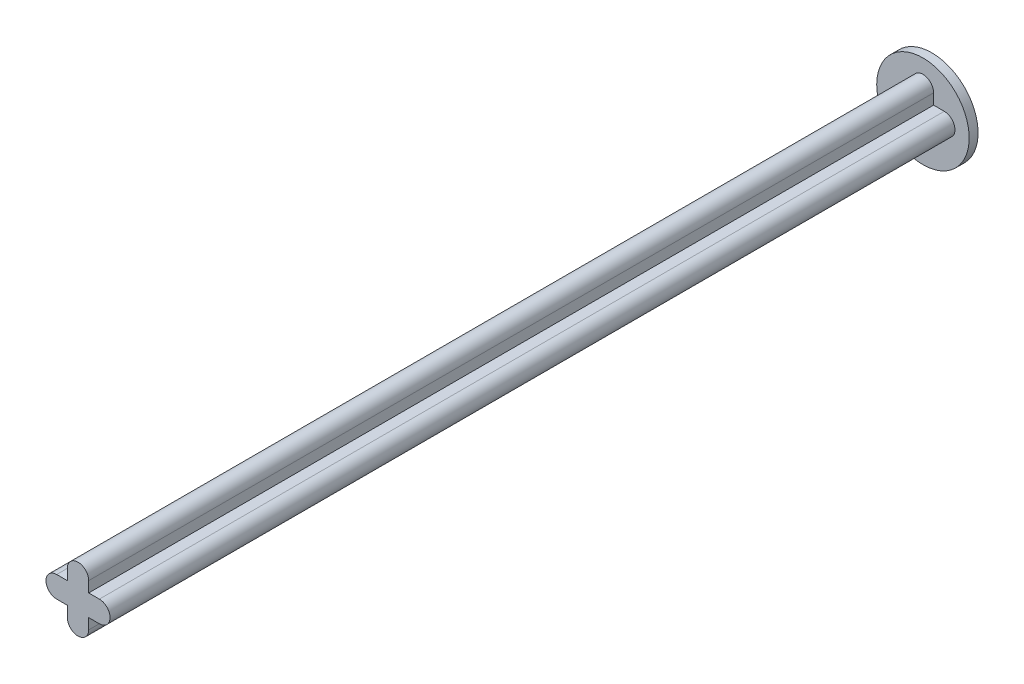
from build123d import *

# Parameters (mm, degrees)
BOSS_EXTRUDE1_DEPTH = 60.96
SKETCH2_R           = 3.302
BOSS_EXTRUDE2_DEPTH = 0.635


with BuildPart() as part:
    # Sketch1 → Boss-Extrude1 (new body)
    with BuildSketch(Plane.XY):
        with BuildLine():
            Line((0, 0.762), (3.048, 0.762))
            ThreePointArc((3.048, 0.762), (3.81, 0), (3.048, -0.762))
            Line((3.048, -0.762), (0, -0.762))
            ThreePointArc((0, -0.762), (-0.762, 0), (0, 0.762))
        make_face()
        with BuildLine():
            Line((2.286, 1.524), (2.286, -1.524))
            ThreePointArc((2.286, -1.524), (1.524, -2.286), (0.762, -1.524))
            Line((0.762, -1.524), (0.762, 1.524))
            ThreePointArc((0.762, 1.524), (1.524, 2.286), (2.286, 1.524))
        make_face()
    extrude(amount=BOSS_EXTRUDE1_DEPTH)

    # Sketch2 → Boss-Extrude2 (add)
    with BuildSketch(Plane(origin=(0, 0, 0), x_dir=(-1, 0, 0), z_dir=(0, 0, -1))):
        with Locations((-1.524, 0)):
            Circle(SKETCH2_R)
    extrude(amount=-BOSS_EXTRUDE2_DEPTH)


solid = part.part
